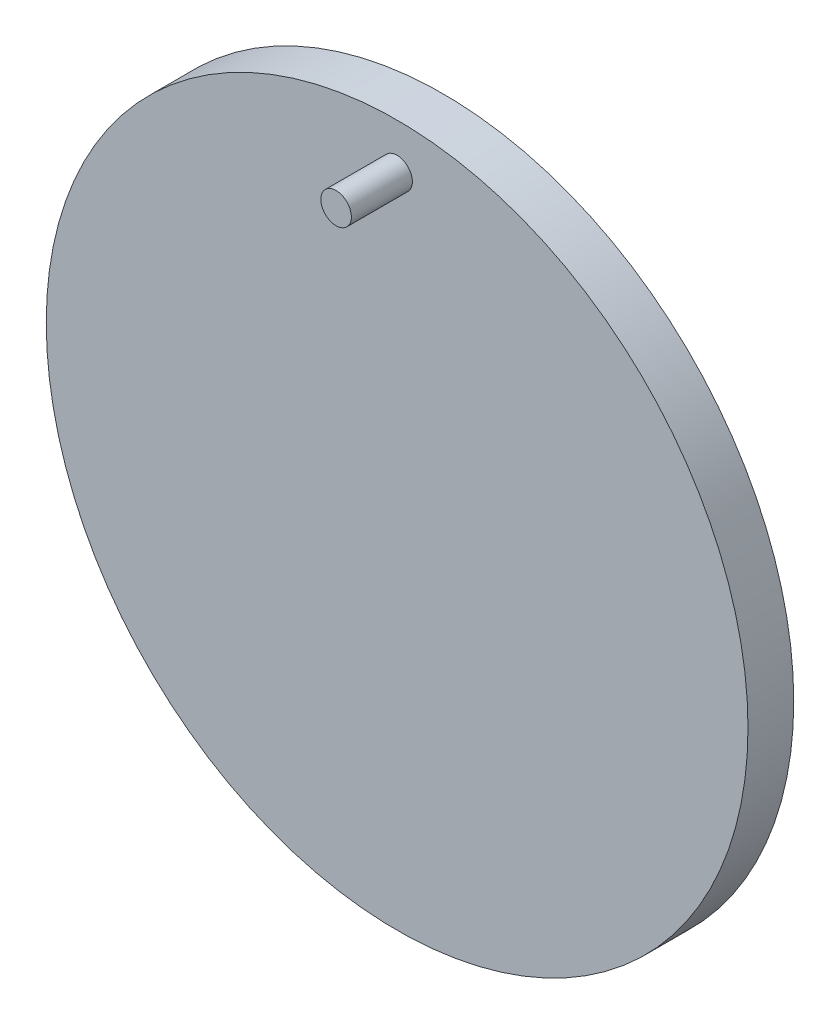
from build123d import *

# Parameters (mm, degrees)
SKETCH1_R      = 115
EXTRUDE1_DEPTH = 15
SKETCH2_R      = 5
EXTRUDE2_DEPTH = 20


with BuildPart() as part:
    # Sketch1 → Extrude1 (new body)
    with BuildSketch(Plane.XY):
        Circle(SKETCH1_R)
    extrude(amount=-EXTRUDE1_DEPTH)

    # Sketch2 → Extrude2 (add)
    with BuildSketch(Plane.XY):
        with Locations((0, 100)):
            Circle(SKETCH2_R)
    extrude(amount=EXTRUDE2_DEPTH)


solid = part.part
